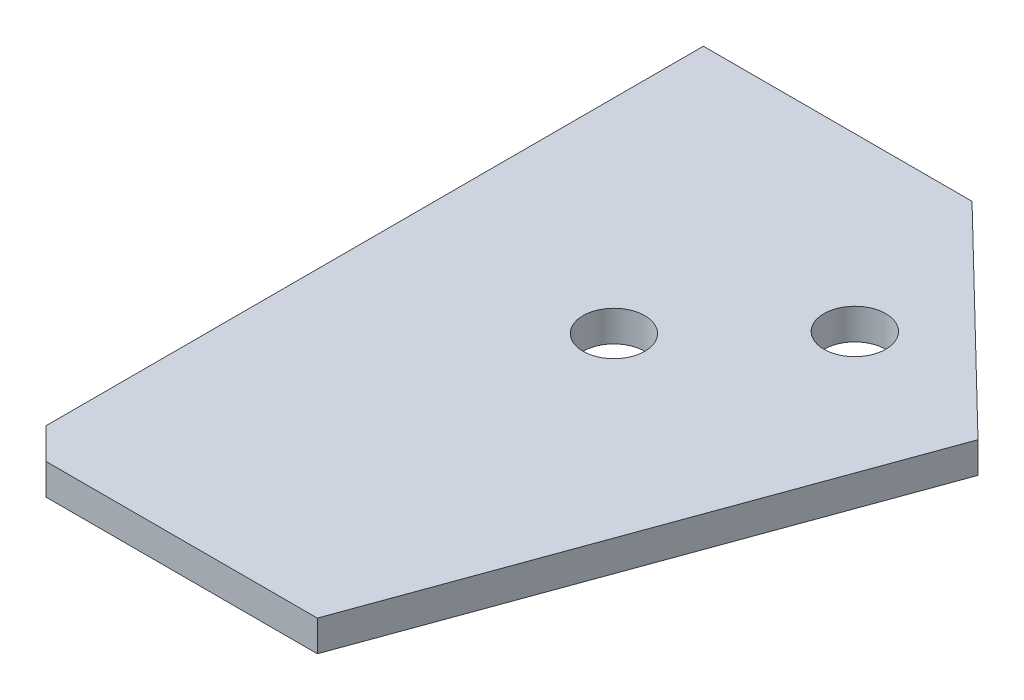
ISO-10303-21;
HEADER;
FILE_DESCRIPTION(('STEP AP214'),'2;1');
FILE_NAME('part.step','',(''),(''),'','','');
FILE_SCHEMA(('AUTOMOTIVE_DESIGN { 1 0 10303 214 1 1 1 1 }'));
ENDSEC;
DATA;
#1=APPLICATION_CONTEXT('core data for automotive mechanical design processes');
#2=APPLICATION_PROTOCOL_DEFINITION('international standard','automotive_design',2000,#1);
#3=PRODUCT_CONTEXT('',#1,'mechanical');
#4=PRODUCT('Part','Part','',(#3));
#5=PRODUCT_RELATED_PRODUCT_CATEGORY('part','',(#4));
#6=PRODUCT_DEFINITION_FORMATION('','',#4);
#7=PRODUCT_DEFINITION_CONTEXT('part definition',#1,'design');
#8=PRODUCT_DEFINITION('design','',#6,#7);
#9=PRODUCT_DEFINITION_SHAPE('','',#8);
#10=(LENGTH_UNIT() NAMED_UNIT(*) SI_UNIT(.MILLI.,.METRE.));
#11=(NAMED_UNIT(*) PLANE_ANGLE_UNIT() SI_UNIT($,.RADIAN.));
#12=(NAMED_UNIT(*) SI_UNIT($,.STERADIAN.) SOLID_ANGLE_UNIT());
#13=UNCERTAINTY_MEASURE_WITH_UNIT(LENGTH_MEASURE(1.E-05),#10,'distance_accuracy_value','');
#14=(GEOMETRIC_REPRESENTATION_CONTEXT(3) GLOBAL_UNCERTAINTY_ASSIGNED_CONTEXT((#13)) GLOBAL_UNIT_ASSIGNED_CONTEXT((#10,
#11,#12)) REPRESENTATION_CONTEXT('',''));
#15=CARTESIAN_POINT('',(0.,0.,0.));
#16=DIRECTION('',(0.,0.,1.));
#17=DIRECTION('',(1.,0.,0.));
#18=AXIS2_PLACEMENT_3D('',#15,#16,#17);
#19=CARTESIAN_POINT('',(0.,6.35,0.));
#20=DIRECTION('',(1.,0.,0.));
#21=DIRECTION('',(0.,0.,-1.));
#22=AXIS2_PLACEMENT_3D('',#19,#20,#21);
#23=PLANE('',#22);
#24=DIRECTION('',(0.,0.,1.));
#25=VECTOR('',#24,1.);
#26=CARTESIAN_POINT('',(0.,-6.35,0.));
#27=LINE('',#26,#25);
#28=CARTESIAN_POINT('',(0.,-6.35,-282.823836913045));
#29=VERTEX_POINT('',#28);
#30=CARTESIAN_POINT('',(0.,-6.35,-12.7));
#31=VERTEX_POINT('',#30);
#32=EDGE_CURVE('E122',#29,#31,#27,.T.);
#33=ORIENTED_EDGE('',*,*,#32,.T.);
#34=DIRECTION('',(0.,1.,0.));
#35=VECTOR('',#34,1.);
#36=CARTESIAN_POINT('',(0.,6.35,-12.7));
#37=LINE('',#36,#35);
#38=CARTESIAN_POINT('',(0.,6.35,-12.7));
#39=VERTEX_POINT('',#38);
#40=EDGE_CURVE('E46',#31,#39,#37,.T.);
#41=ORIENTED_EDGE('',*,*,#40,.T.);
#42=DIRECTION('',(0.,0.,1.));
#43=VECTOR('',#42,1.);
#44=CARTESIAN_POINT('',(0.,6.35,0.));
#45=LINE('',#44,#43);
#46=CARTESIAN_POINT('',(0.,6.35,-282.823836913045));
#47=VERTEX_POINT('',#46);
#48=EDGE_CURVE('E100',#47,#39,#45,.T.);
#49=ORIENTED_EDGE('',*,*,#48,.F.);
#50=DIRECTION('',(0.,-1.,0.));
#51=VECTOR('',#50,1.);
#52=CARTESIAN_POINT('',(0.,6.35,-282.823836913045));
#53=LINE('',#52,#51);
#54=EDGE_CURVE('E121',#47,#29,#53,.T.);
#55=ORIENTED_EDGE('',*,*,#54,.T.);
#56=EDGE_LOOP('',(#33,#41,#49,#55));
#57=FACE_BOUND('',#56,.T.);
#58=ADVANCED_FACE('F38',(#57),#23,.F.);
#59=CARTESIAN_POINT('',(0.,6.35,0.));
#60=DIRECTION('',(0.,0.,-1.));
#61=DIRECTION('',(-1.,0.,0.));
#62=AXIS2_PLACEMENT_3D('',#59,#60,#61);
#63=PLANE('',#62);
#64=DIRECTION('',(1.,0.,0.));
#65=VECTOR('',#64,1.);
#66=CARTESIAN_POINT('',(0.,6.35,0.));
#67=LINE('',#66,#65);
#68=CARTESIAN_POINT('',(12.7,6.35,0.));
#69=VERTEX_POINT('',#68);
#70=CARTESIAN_POINT('',(124.2,6.35,0.));
#71=VERTEX_POINT('',#70);
#72=EDGE_CURVE('E90',#69,#71,#67,.T.);
#73=ORIENTED_EDGE('',*,*,#72,.F.);
#74=DIRECTION('',(0.,-1.,0.));
#75=VECTOR('',#74,1.);
#76=CARTESIAN_POINT('',(12.7,6.35,0.));
#77=LINE('',#76,#75);
#78=CARTESIAN_POINT('',(12.7,-6.35,0.));
#79=VERTEX_POINT('',#78);
#80=EDGE_CURVE('E108',#69,#79,#77,.T.);
#81=ORIENTED_EDGE('',*,*,#80,.T.);
#82=DIRECTION('',(1.,0.,0.));
#83=VECTOR('',#82,1.);
#84=CARTESIAN_POINT('',(0.,-6.35,0.));
#85=LINE('',#84,#83);
#86=CARTESIAN_POINT('',(124.2,-6.35,0.));
#87=VERTEX_POINT('',#86);
#88=EDGE_CURVE('E105',#79,#87,#85,.T.);
#89=ORIENTED_EDGE('',*,*,#88,.T.);
#90=DIRECTION('',(0.,-1.,0.));
#91=VECTOR('',#90,1.);
#92=CARTESIAN_POINT('',(124.2,6.35,0.));
#93=LINE('',#92,#91);
#94=EDGE_CURVE('E103',#71,#87,#93,.T.);
#95=ORIENTED_EDGE('',*,*,#94,.F.);
#96=EDGE_LOOP('',(#73,#81,#89,#95));
#97=FACE_BOUND('',#96,.T.);
#98=ADVANCED_FACE('F104',(#97),#63,.F.);
#99=CARTESIAN_POINT('',(124.2,6.35,0.));
#100=DIRECTION('',(-0.940077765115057,0.,-0.340960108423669));
#101=DIRECTION('',(-0.340960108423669,0.,0.940077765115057));
#102=AXIS2_PLACEMENT_3D('',#99,#100,#101);
#103=PLANE('',#102);
#104=DIRECTION('',(0.340960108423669,0.,-0.940077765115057));
#105=VECTOR('',#104,1.);
#106=CARTESIAN_POINT('',(124.2,-6.35,0.));
#107=LINE('',#106,#105);
#108=CARTESIAN_POINT('',(196.451283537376,-6.35,-199.207542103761));
#109=VERTEX_POINT('',#108);
#110=EDGE_CURVE('E126',#87,#109,#107,.T.);
#111=ORIENTED_EDGE('',*,*,#110,.T.);
#112=DIRECTION('',(0.,-1.,0.));
#113=VECTOR('',#112,1.);
#114=CARTESIAN_POINT('',(196.451283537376,6.35,-199.207542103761));
#115=LINE('',#114,#113);
#116=CARTESIAN_POINT('',(196.451283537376,6.35,-199.207542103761));
#117=VERTEX_POINT('',#116);
#118=EDGE_CURVE('E109',#117,#109,#115,.T.);
#119=ORIENTED_EDGE('',*,*,#118,.F.);
#120=DIRECTION('',(0.340960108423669,0.,-0.940077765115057));
#121=VECTOR('',#120,1.);
#122=CARTESIAN_POINT('',(124.2,6.35,0.));
#123=LINE('',#122,#121);
#124=EDGE_CURVE('E94',#71,#117,#123,.T.);
#125=ORIENTED_EDGE('',*,*,#124,.F.);
#126=ORIENTED_EDGE('',*,*,#94,.T.);
#127=EDGE_LOOP('',(#111,#119,#125,#126));
#128=FACE_BOUND('',#127,.T.);
#129=ADVANCED_FACE('F111',(#128),#103,.F.);
#130=CARTESIAN_POINT('',(110.379713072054,6.35,-282.823836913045));
#131=DIRECTION('',(-0.696802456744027,0.,0.717263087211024));
#132=DIRECTION('',(0.717263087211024,0.,0.696802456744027));
#133=AXIS2_PLACEMENT_3D('',#130,#131,#132);
#134=PLANE('',#133);
#135=DIRECTION('',(-0.717263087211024,0.,-0.696802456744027));
#136=VECTOR('',#135,1.);
#137=CARTESIAN_POINT('',(110.379713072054,-6.35,-282.823836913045));
#138=LINE('',#137,#136);
#139=CARTESIAN_POINT('',(110.379713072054,-6.35,-282.823836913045));
#140=VERTEX_POINT('',#139);
#141=EDGE_CURVE('E128',#109,#140,#138,.T.);
#142=ORIENTED_EDGE('',*,*,#141,.T.);
#143=DIRECTION('',(0.,-1.,0.));
#144=VECTOR('',#143,1.);
#145=CARTESIAN_POINT('',(110.379713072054,6.35,-282.823836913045));
#146=LINE('',#145,#144);
#147=CARTESIAN_POINT('',(110.379713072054,6.35,-282.823836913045));
#148=VERTEX_POINT('',#147);
#149=EDGE_CURVE('E134',#148,#140,#146,.T.);
#150=ORIENTED_EDGE('',*,*,#149,.F.);
#151=DIRECTION('',(-0.717263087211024,0.,-0.696802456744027));
#152=VECTOR('',#151,1.);
#153=CARTESIAN_POINT('',(110.379713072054,6.35,-282.823836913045));
#154=LINE('',#153,#152);
#155=EDGE_CURVE('E114',#117,#148,#154,.T.);
#156=ORIENTED_EDGE('',*,*,#155,.F.);
#157=ORIENTED_EDGE('',*,*,#118,.T.);
#158=EDGE_LOOP('',(#142,#150,#156,#157));
#159=FACE_BOUND('',#158,.T.);
#160=ADVANCED_FACE('F144',(#159),#134,.F.);
#161=CARTESIAN_POINT('',(110.379713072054,6.35,-282.823836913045));
#162=DIRECTION('',(0.,0.,1.));
#163=DIRECTION('',(1.,0.,0.));
#164=AXIS2_PLACEMENT_3D('',#161,#162,#163);
#165=PLANE('',#164);
#166=DIRECTION('',(-1.,0.,0.));
#167=VECTOR('',#166,1.);
#168=CARTESIAN_POINT('',(110.379713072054,-6.35,-282.823836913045));
#169=LINE('',#168,#167);
#170=EDGE_CURVE('E130',#140,#29,#169,.T.);
#171=ORIENTED_EDGE('',*,*,#170,.T.);
#172=ORIENTED_EDGE('',*,*,#54,.F.);
#173=DIRECTION('',(-1.,0.,0.));
#174=VECTOR('',#173,1.);
#175=CARTESIAN_POINT('',(110.379713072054,6.35,-282.823836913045));
#176=LINE('',#175,#174);
#177=EDGE_CURVE('E116',#148,#47,#176,.T.);
#178=ORIENTED_EDGE('',*,*,#177,.F.);
#179=ORIENTED_EDGE('',*,*,#149,.T.);
#180=EDGE_LOOP('',(#171,#172,#178,#179));
#181=FACE_BOUND('',#180,.T.);
#182=ADVANCED_FACE('F149',(#181),#165,.F.);
#183=CARTESIAN_POINT('',(0.,6.35,-282.823836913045));
#184=DIRECTION('',(0.,1.,0.));
#185=DIRECTION('',(0.,0.,1.));
#186=AXIS2_PLACEMENT_3D('',#183,#184,#185);
#187=PLANE('',#186);
#188=CARTESIAN_POINT('',(132.613727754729,6.35,-212.427469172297));
#189=DIRECTION('',(0.,1.,0.));
#190=DIRECTION('',(0.,0.,1.));
#191=AXIS2_PLACEMENT_3D('',#188,#189,#190);
#192=CIRCLE('',#191,12.7);
#193=CARTESIAN_POINT('',(132.613727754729,6.35,-199.727469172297));
#194=VERTEX_POINT('',#193);
#195=EDGE_CURVE('E159',#194,#194,#192,.T.);
#196=ORIENTED_EDGE('',*,*,#195,.F.);
#197=EDGE_LOOP('',(#196));
#198=FACE_BOUND('',#197,.T.);
#199=CARTESIAN_POINT('',(83.8375557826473,6.35,-162.219053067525));
#200=DIRECTION('',(0.,1.,0.));
#201=DIRECTION('',(0.,0.,1.));
#202=AXIS2_PLACEMENT_3D('',#199,#200,#201);
#203=CIRCLE('',#202,12.7);
#204=CARTESIAN_POINT('',(83.8375557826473,6.35,-149.519053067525));
#205=VERTEX_POINT('',#204);
#206=EDGE_CURVE('E153',#205,#205,#203,.T.);
#207=ORIENTED_EDGE('',*,*,#206,.F.);
#208=EDGE_LOOP('',(#207));
#209=FACE_BOUND('',#208,.T.);
#210=ORIENTED_EDGE('',*,*,#48,.T.);
#211=DIRECTION('',(-0.707106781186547,0.,-0.707106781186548));
#212=VECTOR('',#211,1.);
#213=CARTESIAN_POINT('',(-135.061918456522,6.35,-147.761918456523));
#214=LINE('',#213,#212);
#215=EDGE_CURVE('E11',#39,#69,#214,.F.);
#216=ORIENTED_EDGE('',*,*,#215,.T.);
#217=ORIENTED_EDGE('',*,*,#72,.T.);
#218=ORIENTED_EDGE('',*,*,#124,.T.);
#219=ORIENTED_EDGE('',*,*,#155,.T.);
#220=ORIENTED_EDGE('',*,*,#177,.T.);
#221=EDGE_LOOP('',(#210,#216,#217,#218,#219,#220));
#222=FACE_BOUND('',#221,.T.);
#223=ADVANCED_FACE('F92',(#198,#209,#222),#187,.T.);
#224=CARTESIAN_POINT('',(0.,-6.35,-282.823836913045));
#225=DIRECTION('',(0.,1.,0.));
#226=DIRECTION('',(0.,0.,1.));
#227=AXIS2_PLACEMENT_3D('',#224,#225,#226);
#228=PLANE('',#227);
#229=CARTESIAN_POINT('',(132.613727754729,-6.35,-212.427469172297));
#230=DIRECTION('',(0.,1.,0.));
#231=DIRECTION('',(0.,0.,1.));
#232=AXIS2_PLACEMENT_3D('',#229,#230,#231);
#233=CIRCLE('',#232,12.7);
#234=CARTESIAN_POINT('',(132.613727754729,-6.35,-199.727469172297));
#235=VERTEX_POINT('',#234);
#236=EDGE_CURVE('E156',#235,#235,#233,.T.);
#237=ORIENTED_EDGE('',*,*,#236,.T.);
#238=EDGE_LOOP('',(#237));
#239=FACE_BOUND('',#238,.T.);
#240=CARTESIAN_POINT('',(83.8375557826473,-6.35,-162.219053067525));
#241=DIRECTION('',(0.,1.,0.));
#242=DIRECTION('',(0.,0.,1.));
#243=AXIS2_PLACEMENT_3D('',#240,#241,#242);
#244=CIRCLE('',#243,12.7);
#245=CARTESIAN_POINT('',(83.8375557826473,-6.35,-149.519053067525));
#246=VERTEX_POINT('',#245);
#247=EDGE_CURVE('E124',#246,#246,#244,.T.);
#248=ORIENTED_EDGE('',*,*,#247,.T.);
#249=EDGE_LOOP('',(#248));
#250=FACE_BOUND('',#249,.T.);
#251=ORIENTED_EDGE('',*,*,#88,.F.);
#252=DIRECTION('',(0.707106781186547,0.,0.707106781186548));
#253=VECTOR('',#252,1.);
#254=CARTESIAN_POINT('',(12.7,-6.35,0.));
#255=LINE('',#254,#253);
#256=EDGE_CURVE('E60',#79,#31,#255,.F.);
#257=ORIENTED_EDGE('',*,*,#256,.T.);
#258=ORIENTED_EDGE('',*,*,#32,.F.);
#259=ORIENTED_EDGE('',*,*,#170,.F.);
#260=ORIENTED_EDGE('',*,*,#141,.F.);
#261=ORIENTED_EDGE('',*,*,#110,.F.);
#262=EDGE_LOOP('',(#251,#257,#258,#259,#260,#261));
#263=FACE_BOUND('',#262,.T.);
#264=ADVANCED_FACE('F140',(#239,#250,#263),#228,.F.);
#265=CARTESIAN_POINT('',(83.8375557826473,6.35,-162.219053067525));
#266=DIRECTION('',(0.,1.,0.));
#267=DIRECTION('',(0.,0.,1.));
#268=AXIS2_PLACEMENT_3D('',#265,#266,#267);
#269=CYLINDRICAL_SURFACE('',#268,12.7);
#270=ORIENTED_EDGE('',*,*,#247,.F.);
#271=EDGE_LOOP('',(#270));
#272=FACE_BOUND('',#271,.T.);
#273=ORIENTED_EDGE('',*,*,#206,.T.);
#274=EDGE_LOOP('',(#273));
#275=FACE_BOUND('',#274,.T.);
#276=ADVANCED_FACE('F170',(#272,#275),#269,.F.);
#277=CARTESIAN_POINT('',(132.613727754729,6.35,-212.427469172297));
#278=DIRECTION('',(0.,1.,0.));
#279=DIRECTION('',(0.,0.,1.));
#280=AXIS2_PLACEMENT_3D('',#277,#278,#279);
#281=CYLINDRICAL_SURFACE('',#280,12.7);
#282=ORIENTED_EDGE('',*,*,#236,.F.);
#283=EDGE_LOOP('',(#282));
#284=FACE_BOUND('',#283,.T.);
#285=ORIENTED_EDGE('',*,*,#195,.T.);
#286=EDGE_LOOP('',(#285));
#287=FACE_BOUND('',#286,.T.);
#288=ADVANCED_FACE('F163',(#284,#287),#281,.F.);
#289=CARTESIAN_POINT('',(12.7,6.35,0.));
#290=DIRECTION('',(0.707106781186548,0.,-0.707106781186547));
#291=DIRECTION('',(-0.707106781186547,0.,-0.707106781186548));
#292=AXIS2_PLACEMENT_3D('',#289,#290,#291);
#293=PLANE('',#292);
#294=ORIENTED_EDGE('',*,*,#215,.F.);
#295=ORIENTED_EDGE('',*,*,#40,.F.);
#296=ORIENTED_EDGE('',*,*,#256,.F.);
#297=ORIENTED_EDGE('',*,*,#80,.F.);
#298=EDGE_LOOP('',(#294,#295,#296,#297));
#299=FACE_BOUND('',#298,.T.);
#300=ADVANCED_FACE('F40',(#299),#293,.F.);
#301=CLOSED_SHELL('',(#58,#98,#129,#160,#182,#223,#264,#276,#288,#300));
#302=MANIFOLD_SOLID_BREP('B2',#301);
#303=ADVANCED_BREP_SHAPE_REPRESENTATION('',(#18,#302),#14);
#304=SHAPE_DEFINITION_REPRESENTATION(#9,#303);
ENDSEC;
END-ISO-10303-21;
